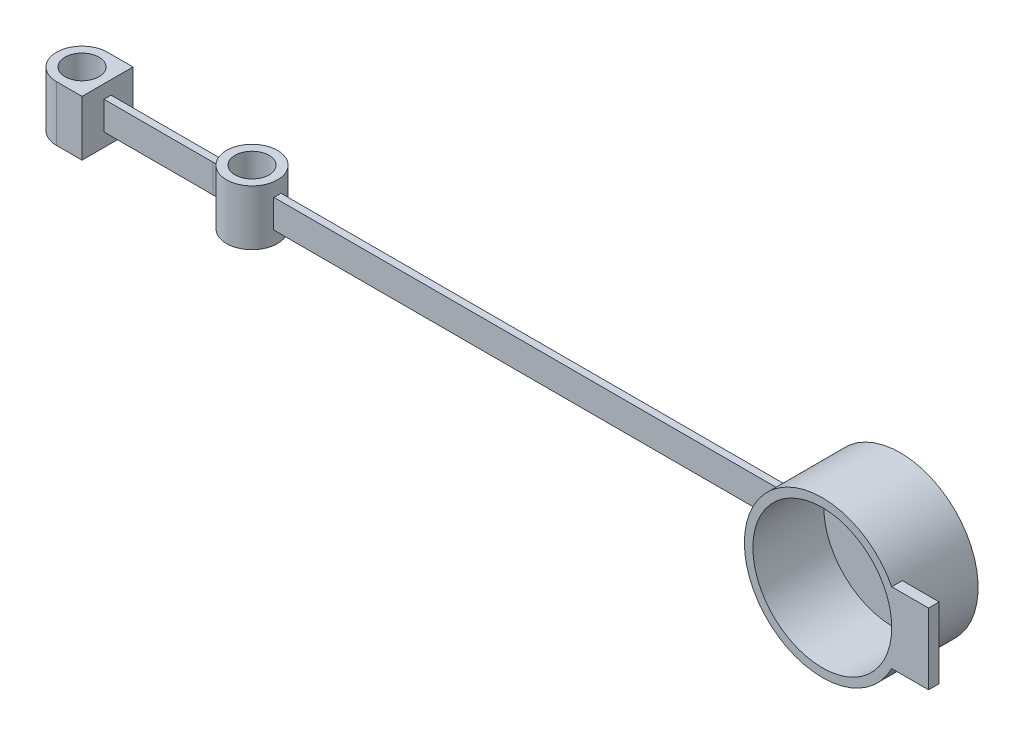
from build123d import *

# Parameters (mm, degrees)
BOSS_EXTRUDE2_DEPTH             = 2
SKETCH12_R                      = 3.6
BOSS_EXTRUDE3_DEPTH             = 3.9
SKETCH13_R                      = 2.4
CUT_EXTRUDE2_DEPTH              = 89.418323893
SKETCH10_W                      = 11
SKETCH10_H                      = 11
SKETCH20_W                      = 1.5
SKETCH20_H                      = 10
BOSS_EXTRUDE5_DEPTH             = 3
BOSS_EXTRUDE5_DIRECTION_2_REACH = 130.293
SKETCH8_W                       = 9.8
SKETCH8_H                       = 11


with BuildPart() as part:
    # Sketch6 → Boss-Extrude2 (new, symmetric)
    with BuildSketch(Plane(origin=(0, 0, 0), x_dir=(1, 0, 0), z_dir=(0, 1, 0))):
        Polygon((88, 0.5), (0, 0.5), (-24, 0.5), (-24, -0.5), (0, -0.5), (88, -0.5), align=None)
    extrude(amount=BOSS_EXTRUDE2_DEPTH, both=True)

    # Sketch12 → Boss-Extrude3 (add, symmetric)
    with BuildSketch(Plane(origin=(0, 0, 0), x_dir=(1, 0, 0), z_dir=(0, 1, 0))):
        with Locations(Location((0, 0, 0), (0, 0, 270))):
            Circle(SKETCH12_R)
        with BuildLine():
            Line((-24, 3.6), (-20.4, 3.6))
            Line((-20.4, 3.6), (-20.4, -3.6))
            Line((-20.4, -3.6), (-24, -3.6))
            ThreePointArc((-24, -3.6), (-27.6, 0), (-24, 3.6))
        make_face()
    extrude(amount=BOSS_EXTRUDE3_DEPTH, both=True)

    # Sketch13 → Cut-Extrude2 (cut, through all)
    with BuildSketch(Plane(origin=(0, 3.9, 0), x_dir=(1, 0, 0), z_dir=(0, 1, 0))):
        with Locations(Location((-24, 0, 0), (0, 0, 270))):
            Circle(SKETCH13_R)
        with Locations(Location((0, 0, 0), (0, 0, 270))):
            Circle(SKETCH13_R)
    extrude(amount=-CUT_EXTRUDE2_DEPTH, mode=Mode.SUBTRACT)

    # Sketch10 → Revolve1 (revolve)
    with BuildSketch(Plane.XZ):
        with Locations((82.5, 2)):
            Rectangle(SKETCH10_W, SKETCH10_H)
    revolve(axis=Axis((88, 0, -3.5), (0, 0, 1)))

    # Sketch20 → Boss-Extrude5 (add)
    with BuildSketch(Plane(origin=(100, 0, 0), x_dir=(0, 0, -1), z_dir=(1, 0, 0))):
        with Locations((-6.75, 0)):
            Rectangle(SKETCH20_W, SKETCH20_H)
    extrude(amount=BOSS_EXTRUDE5_DEPTH)

    # Sketch20 → Boss-Extrude5 direction 2 (add, up to next)
    with BuildSketch(Plane(origin=(100, 0, 0), x_dir=(0, 0, -1), z_dir=(1, 0, 0)), mode=Mode.PRIVATE) as boss_extrude5_direction_2_sk1:
        with Locations((-6.75, 0)):
            Rectangle(SKETCH20_W, SKETCH20_H)
    boss_extrude5_direction_2_tool1 = extrude(boss_extrude5_direction_2_sk1.sketch, amount=-BOSS_EXTRUDE5_DIRECTION_2_REACH, mode=Mode.PRIVATE) - part.part
    add(boss_extrude5_direction_2_tool1.solids().sort_by_distance((100, 0, 6.75))[0])

    # Sketch8 → Cut-Revolve2 (revolve, cut)
    with BuildSketch(Plane(origin=(0, 0, 0), x_dir=(1, 0, 0), z_dir=(0, 1, 0)), mode=Mode.PRIVATE) as cut_revolve2_sk:
        with Locations((83.1, -3)):
            Rectangle(SKETCH8_W, SKETCH8_H)
    revolve(cut_revolve2_sk.sketch.rotate(Axis((88, 0, 18.699979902), (0, 0, -1)), 180), axis=Axis((88, 0, 18.699979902), (0, 0, -1)), mode=Mode.SUBTRACT)


solid = part.part
